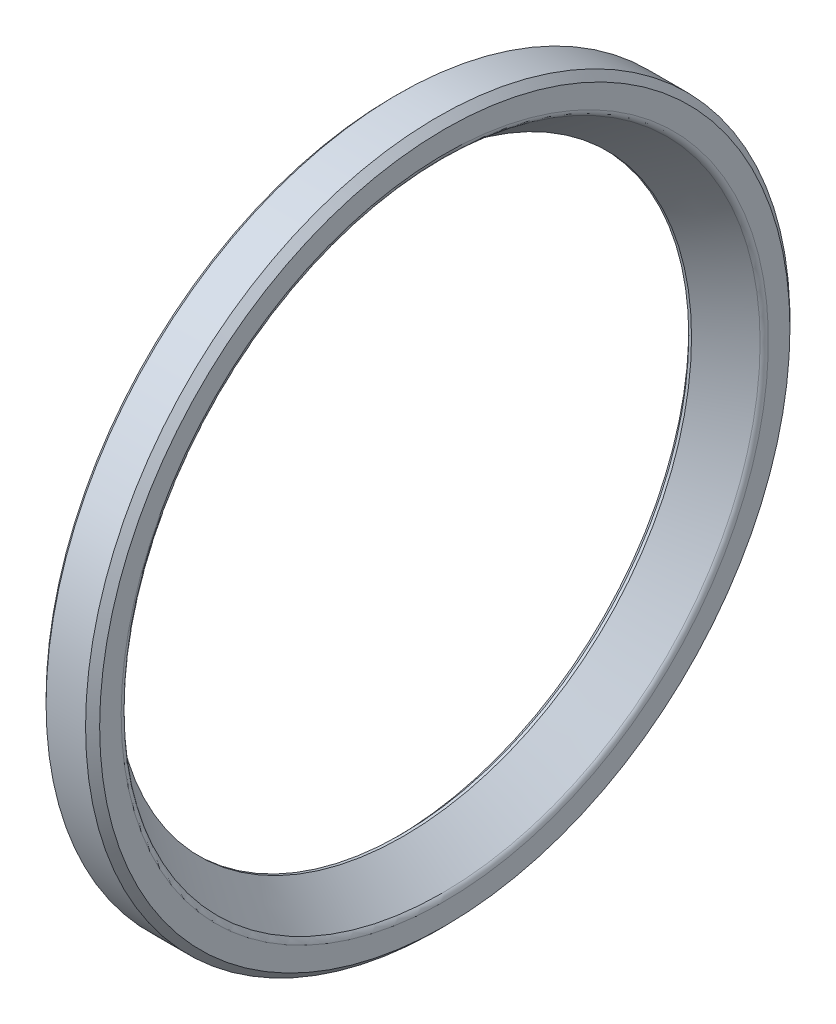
from build123d import *


with BuildPart() as part:
    # Esquisse1 → R_volution1 (revolve)
    with BuildSketch(Plane.XY, mode=Mode.PRIVATE) as r_volution1_sk:
        with BuildLine():
            Line((0, 54.266666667), (0, 53.006060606))
            Line((0, 53.006060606), (0.733333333, 52.272727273))
            Line((0.733333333, 52.272727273), (5.4, 52.272727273))
            ThreePointArc((5.4, 52.272727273), (5.541421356, 52.214148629), (5.6, 52.072727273))
            Line((5.6, 52.072727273), (5.6, 50.051527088))
            ThreePointArc((5.6, 50.051527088), (5.588893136, 50.005723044), (5.558039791, 49.970093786))
            Line((5.558039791, 49.970093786), (2.092350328, 47.5))
            ThreePointArc((2.092350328, 47.5), (1.533333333, 47.75), (0.974316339, 47.5))
            Line((0.974316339, 47.5), (0.2, 47.5))
            Line((0.2, 47.5), (0.2, 45.9))
            Line((0.2, 45.9), (1.1, 45))
            Line((1.1, 45), (1.533333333, 45))
            Line((1.533333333, 45), (7.57284755, 49.669727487))
            ThreePointArc((7.57284755, 49.669727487), (7.88745438, 50.055243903), (8, 50.539943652))
            Line((8, 50.539943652), (8, 53.9))
            Line((8, 53.9), (6.9, 55))
            Line((6.9, 55), (0.733333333, 55))
            Line((0.733333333, 55), (0, 54.266666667))
        make_face()
    revolve(r_volution1_sk.sketch.rotate(Axis((8, 0, 0), (-1, 0, 0)), 270), axis=Axis((8, 0, 0), (-1, 0, 0)))


solid = part.part
